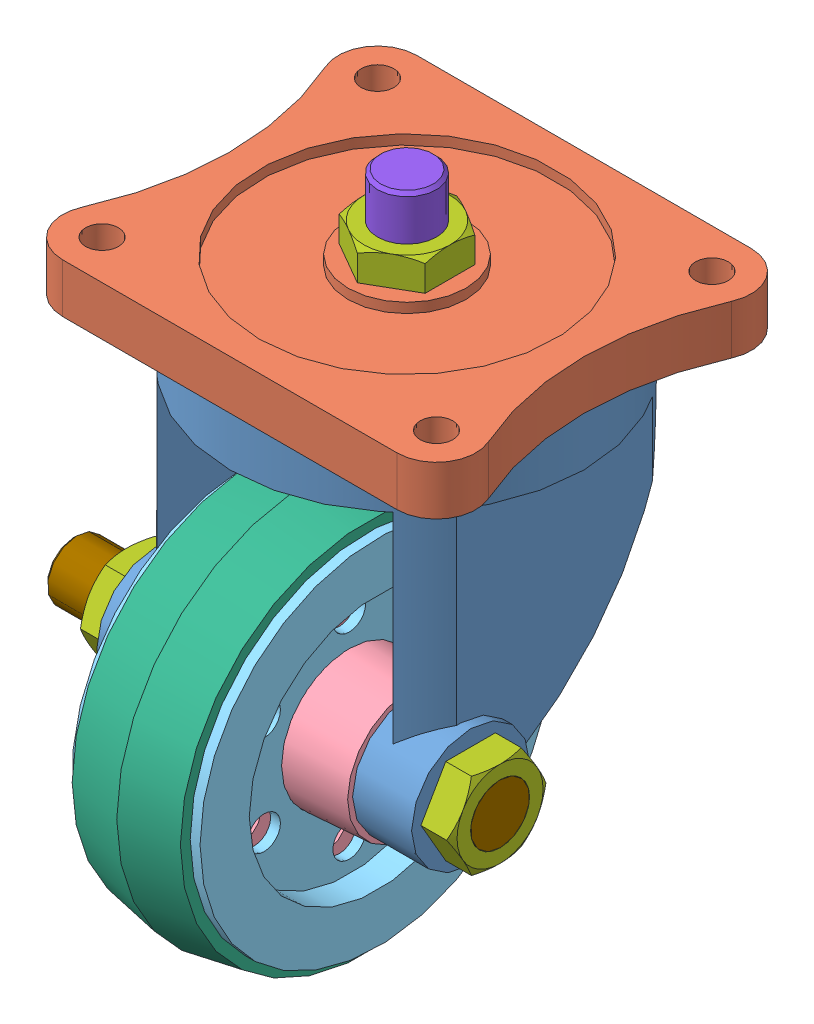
SolidWorks assembly Castor wheel.SLDASM, configuration Default (file format 4700). Lengths in mm.
Overall size (136 187.41 142.53).
13 component instances, 9 part files, 26 mates.
Components (placement in the parent):
- Frame-1: Frame.SLDPRT [Default] at origin size (108 108 108)
- Plate-1: Plate.SLDPRT [Default] at (0 97.5 -28.6156) size (126 15 108)
- Bush-1: Bush.SLDPRT [Default] at origin size (60 24 24)
- Hub-1: Hub.SLDPRT [Default] at origin size (60 84 84)
- Flange-1: Flange.sldprt [Default] at origin size (11.5 108 108)
- Flange-2: Flange.sldprt [Default] x (-1 0 0) z (0 0 -1) size (11.5 108 108)
- Tyre-1: Tyre.sldprt [Default] at origin size (33 119.82 119.82)
- Nut-1: Nut.SLDPRT [Default] at (48 0 0) x (0 -1 0) z (0 0 1) size (26.23 9 30.28)
- Nut-2: Nut.SLDPRT [Default] at (-48 0 0) x (0 1 0) z (0 0 1) size (26.23 9 30.28)
- Nut-3: Nut.SLDPRT [Default] at (0 105 -28.6156) size (26.23 9 30.28)
- Nut-4: Nut.SLDPRT [Default] at (0 76.5 -28.6156) x (-0.914041 0 0.405622) z (0.405622 0 0.914041) size (26.23 9 30.28)
- King-pin-1: King-pin.SLDPRT [Default] at (0 67.5 -28.6156) x (0.397378 0 0.917655) z (-0.917655 0 0.397378) size (18 60 18)
- Shaft-1: Shaft.SLDPRT [Default] at (-73 0 0) x (1 0 0) z (0 0.194588 0.980885) size (130 18 18)
Mates (geometry in assembly coordinates):
- Concentric1: concentric aligned: cylinder of Frame-1 through (0 1 -28.6156) axis (0 1 0) radius 9; cylinder of Plate-1 through (0 90 -28.6156) axis (0 1 0) radius 9
- Coincident1: coincident anti-aligned: plane of Frame-1 through (0 90 -28.6156) normal (0 1 0); plane of Plate-1 through (-51 90 -70.6156) normal (0 -1 0)
- Concentric2: concentric aligned: cylinder of Frame-1 through (48 0 0) axis (-1 0 0) radius 9; cylinder of Bush-1 through (30 0 0) axis (-1 0 0) radius 9
- Coincident2: coincident anti-aligned: plane of Frame-1 through (30 -35.3151 -44.5) normal (-1 0 0); plane of Bush-1 through (30 0 0) normal (1 0 0)
- Concentric3: concentric aligned: cylinder of Bush-1 through (30 0 0) axis (-1 0 0) radius 12; cylinder of Hub-1 through (-30 0 0) axis (-1 0 0) radius 12
- Coincident3: coincident anti-aligned: plane of Frame-1 through (-30 -35.3151 -44.5) normal (1 0 0); plane of Hub-1 through (-30 19.5 0) normal (-1 0 0)
- Concentric4: concentric aligned: cylinder of Hub-1 through (-30 30 0) axis (1 0 0) radius 5; cylinder of Flange-1 through (8 30 0) axis (1 0 0) radius 5
- Concentric5: concentric aligned: cylinder of Hub-1 through (-30 15 -25.9808) axis (1 0 0) radius 5; cylinder of Flange-1 through (8 15 -25.9808) axis (1 0 0) radius 5
- Distance1: distance = 3 mm anti-aligned: plane of Hub-1 through (5 42 0) normal (1 0 0); plane of Flange-1 through (8 20.82 0) normal (-1 0 0)
- Concentric6: concentric anti-aligned: cylinder of Hub-1 through (-30 30 0) axis (1 0 0) radius 5; cylinder of Flange-2 through (-8 30 0) axis (-1 0 0) radius 5
- Concentric7: concentric anti-aligned: cylinder of Hub-1 through (-30 15 -25.9808) axis (1 0 0) radius 5; cylinder of Flange-2 through (-8 15 -25.9808) axis (-1 0 0) radius 5
- Distance2: distance = 3 mm anti-aligned: plane of Hub-1 through (-5 42 0) normal (-1 0 0); plane of Flange-2 through (-8 20.82 0) normal (1 0 0)
- Concentric8: concentric anti-aligned: cylinder of Hub-1 through (-30 0 0) axis (-1 0 0) radius 42; cylinder of Tyre-1 through (0 0 0) axis (1 0 0) radius 42
- Coincident9: coincident anti-aligned: plane of Flange-2 through (-16.5 42 0) normal (1 0 0); plane of Tyre-1 through (-16.5 42 0) normal (-1 0 0)
- Concentric9: concentric aligned: cylinder of Frame-1 through (48 0 0) axis (-1 0 0) radius 9; cylinder of Nut-1 through (57 0 0) axis (-1 0 0) radius 9
- Coincident10: coincident anti-aligned: plane of Frame-1 through (48 0 0) normal (1 0 0); plane of Nut-1 through (48 0 -15.1419) normal (-1 0 0)
- Concentric10: concentric anti-aligned: cylinder of Frame-1 through (48 0 0) axis (-1 0 0) radius 9; cylinder of Nut-2 through (-57 0 0) axis (1 0 0) radius 9
- Coincident11: coincident anti-aligned: plane of Frame-1 through (-48 0 0) normal (-1 0 0); plane of Nut-2 through (-48 0 -15.1419) normal (1 0 0)
- Concentric11: concentric anti-aligned: cylinder of Plate-1 through (0 90 -28.6156) axis (0 1 0) radius 9; cylinder of Nut-3 through (0 114 -28.6156) axis (0 -1 0) radius 9
- Coincident12: coincident anti-aligned: plane of Plate-1 through (-51 105 -70.6156) normal (0 1 0); plane of Nut-3 through (0 105 -43.7575) normal (0 -1 0)
- Concentric12: concentric aligned: cylinder of Frame-1 through (0 1 -28.6156) axis (0 1 0) radius 9; cylinder of Nut-4 through (0 67.5 -28.6156) axis (0 1 0) radius 9
- Coincident13: coincident anti-aligned: plane of Frame-1 through (0 76.5 -28.6156) normal (0 -1 0); plane of Nut-4 through (-6.1419 76.5 -42.4559) normal (0 1 0)
- Concentric13: concentric anti-aligned: cylinder of Nut-4 through (0 67.5 -28.6156) axis (0 1 0) radius 9; cylinder of King-pin-1 through (0 127.5 -28.6156) axis (0 -1 0) radius 9
- Coincident14: coincident aligned: plane of Nut-4 through (-6.1419 67.5 -42.4559) normal (0 -1 0); plane of King-pin-1 through (0 67.5 -28.6156) normal (0 -1 0)
- Concentric14: concentric anti-aligned: cylinder of Nut-2 through (-57 0 0) axis (1 0 0) radius 9; cylinder of Shaft-1 through (57 0 0) axis (-1 0 0) radius 9
- Coincident15: coincident aligned: plane of Nut-1 through (57 0 -15.1419) normal (1 0 0); plane of Shaft-1 through (57 0 0) normal (1 0 0)
